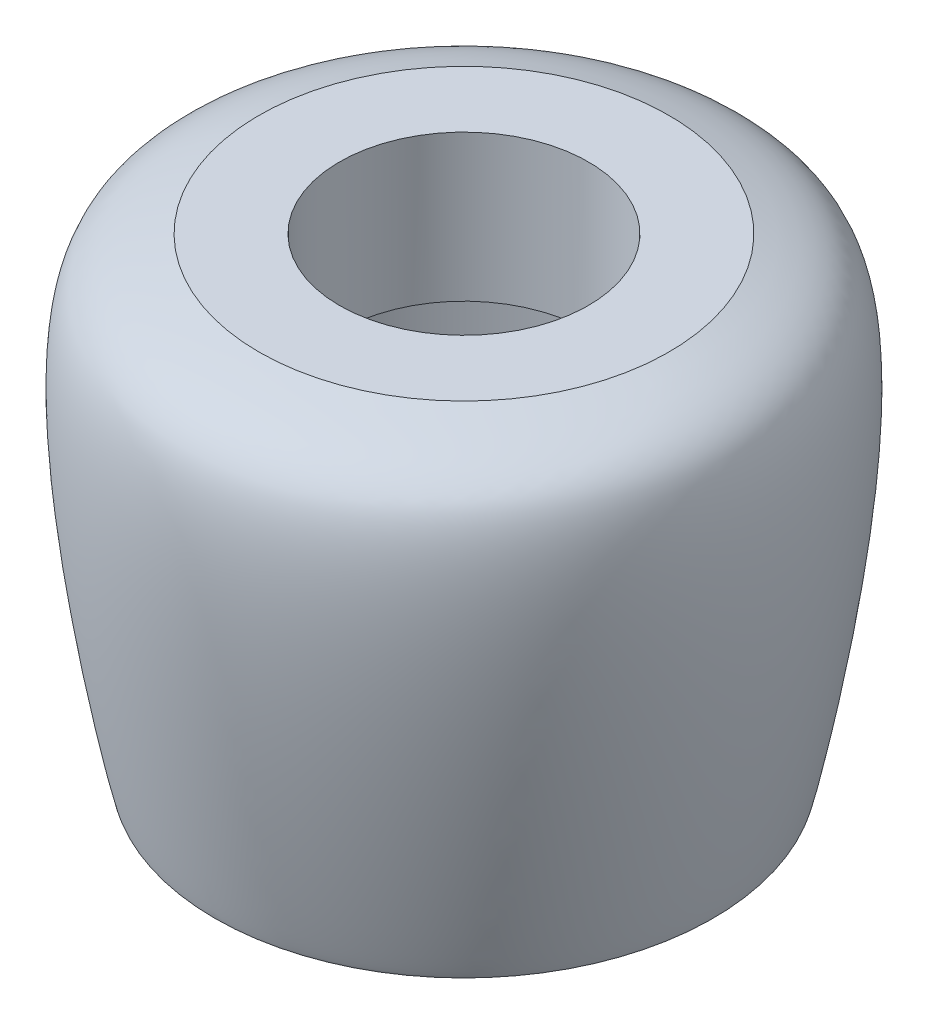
ISO-10303-21;
HEADER;
FILE_DESCRIPTION(('STEP AP214'),'2;1');
FILE_NAME('part.step','',(''),(''),'','','');
FILE_SCHEMA(('AUTOMOTIVE_DESIGN { 1 0 10303 214 1 1 1 1 }'));
ENDSEC;
DATA;
#1=APPLICATION_CONTEXT('core data for automotive mechanical design processes');
#2=APPLICATION_PROTOCOL_DEFINITION('international standard','automotive_design',2000,#1);
#3=PRODUCT_CONTEXT('',#1,'mechanical');
#4=PRODUCT('Part','Part','',(#3));
#5=PRODUCT_RELATED_PRODUCT_CATEGORY('part','',(#4));
#6=PRODUCT_DEFINITION_FORMATION('','',#4);
#7=PRODUCT_DEFINITION_CONTEXT('part definition',#1,'design');
#8=PRODUCT_DEFINITION('design','',#6,#7);
#9=PRODUCT_DEFINITION_SHAPE('','',#8);
#10=(LENGTH_UNIT() NAMED_UNIT(*) SI_UNIT(.MILLI.,.METRE.));
#11=(NAMED_UNIT(*) PLANE_ANGLE_UNIT() SI_UNIT($,.RADIAN.));
#12=(NAMED_UNIT(*) SI_UNIT($,.STERADIAN.) SOLID_ANGLE_UNIT());
#13=UNCERTAINTY_MEASURE_WITH_UNIT(LENGTH_MEASURE(1.E-05),#10,'distance_accuracy_value','');
#14=(GEOMETRIC_REPRESENTATION_CONTEXT(3) GLOBAL_UNCERTAINTY_ASSIGNED_CONTEXT((#13)) GLOBAL_UNIT_ASSIGNED_CONTEXT((#10,
#11,#12)) REPRESENTATION_CONTEXT('',''));
#15=CARTESIAN_POINT('',(0.,0.,0.));
#16=DIRECTION('',(0.,0.,1.));
#17=DIRECTION('',(1.,0.,0.));
#18=AXIS2_PLACEMENT_3D('',#15,#16,#17);
#19=CARTESIAN_POINT('',(8.50000000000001,-19.714330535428,0.));
#20=DIRECTION('',(0.,1.,0.));
#21=DIRECTION('',(0.,0.,1.));
#22=AXIS2_PLACEMENT_3D('',#19,#20,#21);
#23=PLANE('',#22);
#24=CARTESIAN_POINT('',(0.,-19.714330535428,0.));
#25=DIRECTION('',(0.,-1.,0.));
#26=DIRECTION('',(0.,0.,-1.));
#27=AXIS2_PLACEMENT_3D('',#24,#25,#26);
#28=CIRCLE('',#27,8.4210292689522);
#29=CARTESIAN_POINT('',(0.,-19.714330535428,-8.4210292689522));
#30=VERTEX_POINT('',#29);
#31=EDGE_CURVE('E47',#30,#30,#28,.T.);
#32=ORIENTED_EDGE('',*,*,#31,.F.);
#33=EDGE_LOOP('',(#32));
#34=FACE_BOUND('',#33,.T.);
#35=CARTESIAN_POINT('',(0.,-19.714330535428,0.));
#36=DIRECTION('',(0.,1.,0.));
#37=DIRECTION('',(0.,0.,1.));
#38=AXIS2_PLACEMENT_3D('',#35,#36,#37);
#39=CIRCLE('',#38,8.50000000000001);
#40=CARTESIAN_POINT('',(0.,-19.714330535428,8.50000000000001));
#41=VERTEX_POINT('',#40);
#42=EDGE_CURVE('E10',#41,#41,#39,.T.);
#43=ORIENTED_EDGE('',*,*,#42,.F.);
#44=EDGE_LOOP('',(#43));
#45=FACE_BOUND('',#44,.T.);
#46=ADVANCED_FACE('F29',(#34,#45),#23,.F.);
#47=CARTESIAN_POINT('',(8.50000000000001,-19.7143305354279,0.));
#48=CARTESIAN_POINT('',(8.67833819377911,-19.2333255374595,0.));
#49=CARTESIAN_POINT('',(11.2158428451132,-7.42545886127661,0.));
#50=CARTESIAN_POINT('',(9.01411364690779,-4.3220385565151,0.));
#51=CARTESIAN_POINT('',(8.0070568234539,-4.01818454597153,0.));
#52=CARTESIAN_POINT('',(7.00000000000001,-3.71433053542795,0.));
#53=B_SPLINE_CURVE_WITH_KNOTS('',3,(#47,#48,#49,#50,#51,#52),.UNSPECIFIED.,.F.,.F.,(4,2,4),(0.,
0.779316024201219,1.),.UNSPECIFIED.);
#54=CARTESIAN_POINT('',(0.,84.3449333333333,0.));
#55=DIRECTION('',(0.,1.,0.));
#56=AXIS1_PLACEMENT('',#54,#55);
#57=SURFACE_OF_REVOLUTION('',#53,#56);
#58=CARTESIAN_POINT('',(0.,-3.71433053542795,0.));
#59=DIRECTION('',(0.,1.,0.));
#60=DIRECTION('',(0.,0.,1.));
#61=AXIS2_PLACEMENT_3D('',#58,#59,#60);
#62=CIRCLE('',#61,7.00000000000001);
#63=CARTESIAN_POINT('',(0.,-3.71433053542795,7.00000000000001));
#64=VERTEX_POINT('',#63);
#65=EDGE_CURVE('E36',#64,#64,#62,.T.);
#66=ORIENTED_EDGE('',*,*,#65,.F.);
#67=EDGE_LOOP('',(#66));
#68=FACE_BOUND('',#67,.T.);
#69=ORIENTED_EDGE('',*,*,#42,.T.);
#70=EDGE_LOOP('',(#69));
#71=FACE_BOUND('',#70,.T.);
#72=ADVANCED_FACE('F52',(#68,#71),#57,.T.);
#73=CARTESIAN_POINT('',(0.,-3.71433053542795,0.));
#74=DIRECTION('',(0.,-1.,0.));
#75=DIRECTION('',(0.,0.,-1.));
#76=AXIS2_PLACEMENT_3D('',#73,#74,#75);
#77=PLANE('',#76);
#78=CARTESIAN_POINT('',(0.,-3.71433053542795,0.));
#79=DIRECTION('',(0.,1.,0.));
#80=DIRECTION('',(0.,0.,1.));
#81=AXIS2_PLACEMENT_3D('',#78,#79,#80);
#82=CIRCLE('',#81,4.25);
#83=CARTESIAN_POINT('',(0.,-3.71433053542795,4.25));
#84=VERTEX_POINT('',#83);
#85=EDGE_CURVE('E84',#84,#84,#82,.T.);
#86=ORIENTED_EDGE('',*,*,#85,.F.);
#87=EDGE_LOOP('',(#86));
#88=FACE_BOUND('',#87,.T.);
#89=ORIENTED_EDGE('',*,*,#65,.T.);
#90=EDGE_LOOP('',(#89));
#91=FACE_BOUND('',#90,.T.);
#92=ADVANCED_FACE('F55',(#88,#91),#77,.F.);
#93=CARTESIAN_POINT('',(0.,-8.71433053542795,0.));
#94=DIRECTION('',(0.,-1.,0.));
#95=DIRECTION('',(0.,0.,-1.));
#96=AXIS2_PLACEMENT_3D('',#93,#94,#95);
#97=CYLINDRICAL_SURFACE('',#96,8.4210292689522);
#98=CARTESIAN_POINT('',(0.,-8.71433053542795,0.));
#99=DIRECTION('',(0.,-1.,0.));
#100=DIRECTION('',(0.,0.,-1.));
#101=AXIS2_PLACEMENT_3D('',#98,#99,#100);
#102=CIRCLE('',#101,8.4210292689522);
#103=CARTESIAN_POINT('',(0.,-8.71433053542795,-8.4210292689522));
#104=VERTEX_POINT('',#103);
#105=EDGE_CURVE('E40',#104,#104,#102,.T.);
#106=ORIENTED_EDGE('',*,*,#105,.F.);
#107=EDGE_LOOP('',(#106));
#108=FACE_BOUND('',#107,.T.);
#109=ORIENTED_EDGE('',*,*,#31,.T.);
#110=EDGE_LOOP('',(#109));
#111=FACE_BOUND('',#110,.T.);
#112=ADVANCED_FACE('F59',(#108,#111),#97,.F.);
#113=CARTESIAN_POINT('',(0.,-8.71433053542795,0.));
#114=DIRECTION('',(0.,-1.,0.));
#115=DIRECTION('',(0.,0.,-1.));
#116=AXIS2_PLACEMENT_3D('',#113,#114,#115);
#117=PLANE('',#116);
#118=CARTESIAN_POINT('',(0.,-8.71433053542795,0.));
#119=DIRECTION('',(0.,-1.,0.));
#120=DIRECTION('',(0.,0.,-1.));
#121=AXIS2_PLACEMENT_3D('',#118,#119,#120);
#122=CIRCLE('',#121,4.25);
#123=CARTESIAN_POINT('',(0.,-8.71433053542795,-4.25));
#124=VERTEX_POINT('',#123);
#125=EDGE_CURVE('E32',#124,#124,#122,.T.);
#126=ORIENTED_EDGE('',*,*,#125,.F.);
#127=EDGE_LOOP('',(#126));
#128=FACE_BOUND('',#127,.T.);
#129=ORIENTED_EDGE('',*,*,#105,.T.);
#130=EDGE_LOOP('',(#129));
#131=FACE_BOUND('',#130,.T.);
#132=ADVANCED_FACE('F63',(#128,#131),#117,.T.);
#133=CARTESIAN_POINT('',(0.,-14.714330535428,0.));
#134=DIRECTION('',(0.,1.,0.));
#135=DIRECTION('',(0.,0.,1.));
#136=AXIS2_PLACEMENT_3D('',#133,#134,#135);
#137=CYLINDRICAL_SURFACE('',#136,4.25);
#138=ORIENTED_EDGE('',*,*,#125,.T.);
#139=EDGE_LOOP('',(#138));
#140=FACE_BOUND('',#139,.T.);
#141=ORIENTED_EDGE('',*,*,#85,.T.);
#142=EDGE_LOOP('',(#141));
#143=FACE_BOUND('',#142,.T.);
#144=ADVANCED_FACE('F67',(#140,#143),#137,.F.);
#145=CLOSED_SHELL('',(#46,#72,#92,#112,#132,#144));
#146=MANIFOLD_SOLID_BREP('B2',#145);
#147=ADVANCED_BREP_SHAPE_REPRESENTATION('',(#18,#146),#14);
#148=SHAPE_DEFINITION_REPRESENTATION(#9,#147);
ENDSEC;
END-ISO-10303-21;
